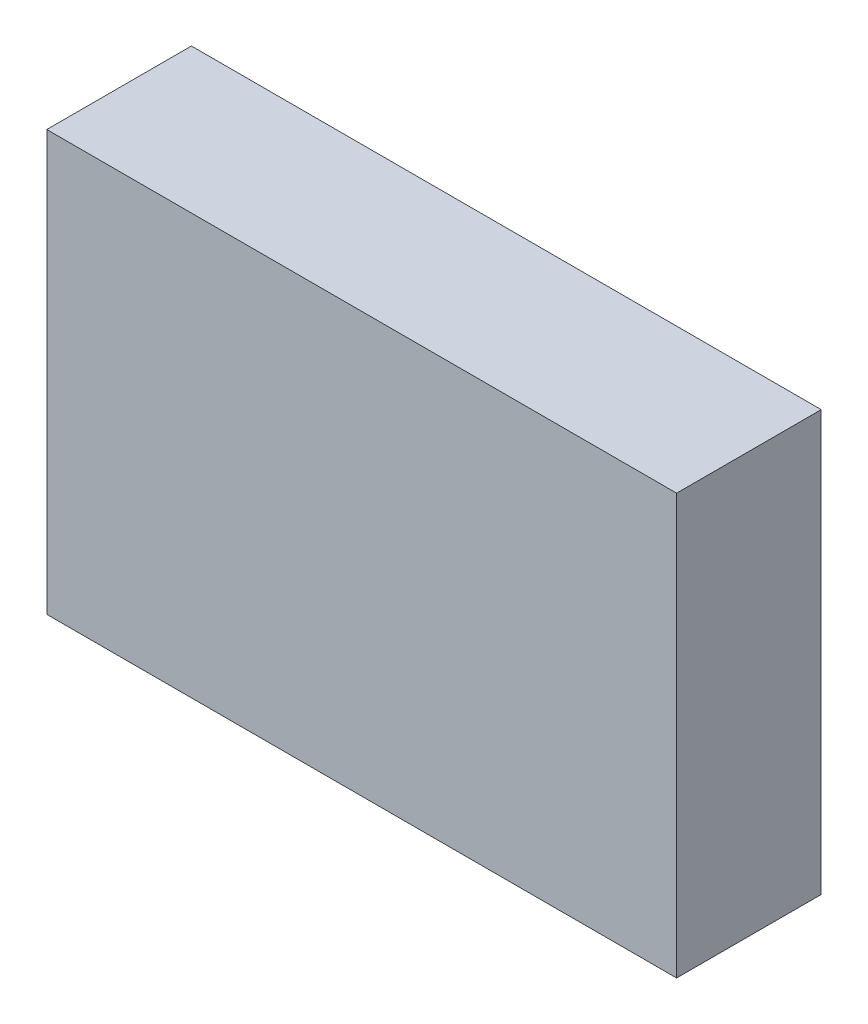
ISO-10303-21;
HEADER;
FILE_DESCRIPTION(('STEP AP214'),'2;1');
FILE_NAME('part.step','',(''),(''),'','','');
FILE_SCHEMA(('AUTOMOTIVE_DESIGN { 1 0 10303 214 1 1 1 1 }'));
ENDSEC;
DATA;
#1=APPLICATION_CONTEXT('core data for automotive mechanical design processes');
#2=APPLICATION_PROTOCOL_DEFINITION('international standard','automotive_design',2000,#1);
#3=PRODUCT_CONTEXT('',#1,'mechanical');
#4=PRODUCT('Part','Part','',(#3));
#5=PRODUCT_RELATED_PRODUCT_CATEGORY('part','',(#4));
#6=PRODUCT_DEFINITION_FORMATION('','',#4);
#7=PRODUCT_DEFINITION_CONTEXT('part definition',#1,'design');
#8=PRODUCT_DEFINITION('design','',#6,#7);
#9=PRODUCT_DEFINITION_SHAPE('','',#8);
#10=(LENGTH_UNIT() NAMED_UNIT(*) SI_UNIT(.MILLI.,.METRE.));
#11=(NAMED_UNIT(*) PLANE_ANGLE_UNIT() SI_UNIT($,.RADIAN.));
#12=(NAMED_UNIT(*) SI_UNIT($,.STERADIAN.) SOLID_ANGLE_UNIT());
#13=UNCERTAINTY_MEASURE_WITH_UNIT(LENGTH_MEASURE(1.E-05),#10,'distance_accuracy_value','');
#14=(GEOMETRIC_REPRESENTATION_CONTEXT(3) GLOBAL_UNCERTAINTY_ASSIGNED_CONTEXT((#13)) GLOBAL_UNIT_ASSIGNED_CONTEXT((#10,
#11,#12)) REPRESENTATION_CONTEXT('',''));
#15=CARTESIAN_POINT('',(0.,0.,0.));
#16=DIRECTION('',(0.,0.,1.));
#17=DIRECTION('',(1.,0.,0.));
#18=AXIS2_PLACEMENT_3D('',#15,#16,#17);
#19=CARTESIAN_POINT('',(-3.81,2.54,1.75));
#20=DIRECTION('',(1.,0.,0.));
#21=DIRECTION('',(0.,0.,-1.));
#22=AXIS2_PLACEMENT_3D('',#19,#20,#21);
#23=PLANE('',#22);
#24=DIRECTION('',(0.,-1.,0.));
#25=VECTOR('',#24,1.);
#26=CARTESIAN_POINT('',(-3.81,2.54,0.));
#27=LINE('',#26,#25);
#28=CARTESIAN_POINT('',(-3.81,2.54,0.));
#29=VERTEX_POINT('',#28);
#30=CARTESIAN_POINT('',(-3.81,-2.54,0.));
#31=VERTEX_POINT('',#30);
#32=EDGE_CURVE('E96',#29,#31,#27,.T.);
#33=ORIENTED_EDGE('',*,*,#32,.T.);
#34=DIRECTION('',(0.,0.,-1.));
#35=VECTOR('',#34,1.);
#36=CARTESIAN_POINT('',(-3.81,-2.54,1.75));
#37=LINE('',#36,#35);
#38=CARTESIAN_POINT('',(-3.81,-2.54,1.75));
#39=VERTEX_POINT('',#38);
#40=EDGE_CURVE('E11',#39,#31,#37,.T.);
#41=ORIENTED_EDGE('',*,*,#40,.F.);
#42=DIRECTION('',(0.,-1.,0.));
#43=VECTOR('',#42,1.);
#44=CARTESIAN_POINT('',(-3.81,2.54,1.75));
#45=LINE('',#44,#43);
#46=CARTESIAN_POINT('',(-3.81,2.54,1.75));
#47=VERTEX_POINT('',#46);
#48=EDGE_CURVE('E84',#47,#39,#45,.T.);
#49=ORIENTED_EDGE('',*,*,#48,.F.);
#50=DIRECTION('',(0.,0.,-1.));
#51=VECTOR('',#50,1.);
#52=CARTESIAN_POINT('',(-3.81,2.54,1.75));
#53=LINE('',#52,#51);
#54=EDGE_CURVE('E92',#47,#29,#53,.T.);
#55=ORIENTED_EDGE('',*,*,#54,.T.);
#56=EDGE_LOOP('',(#33,#41,#49,#55));
#57=FACE_BOUND('',#56,.T.);
#58=ADVANCED_FACE('F33',(#57),#23,.F.);
#59=CARTESIAN_POINT('',(-3.81,-2.54,1.75));
#60=DIRECTION('',(0.,1.,0.));
#61=DIRECTION('',(0.,0.,1.));
#62=AXIS2_PLACEMENT_3D('',#59,#60,#61);
#63=PLANE('',#62);
#64=DIRECTION('',(1.,0.,0.));
#65=VECTOR('',#64,1.);
#66=CARTESIAN_POINT('',(-3.81,-2.54,0.));
#67=LINE('',#66,#65);
#68=CARTESIAN_POINT('',(3.81,-2.54,0.));
#69=VERTEX_POINT('',#68);
#70=EDGE_CURVE('E88',#31,#69,#67,.T.);
#71=ORIENTED_EDGE('',*,*,#70,.T.);
#72=DIRECTION('',(0.,0.,-1.));
#73=VECTOR('',#72,1.);
#74=CARTESIAN_POINT('',(3.81,-2.54,1.75));
#75=LINE('',#74,#73);
#76=CARTESIAN_POINT('',(3.81,-2.54,1.75));
#77=VERTEX_POINT('',#76);
#78=EDGE_CURVE('E41',#77,#69,#75,.T.);
#79=ORIENTED_EDGE('',*,*,#78,.F.);
#80=DIRECTION('',(1.,0.,0.));
#81=VECTOR('',#80,1.);
#82=CARTESIAN_POINT('',(-3.81,-2.54,1.75));
#83=LINE('',#82,#81);
#84=EDGE_CURVE('E79',#39,#77,#83,.T.);
#85=ORIENTED_EDGE('',*,*,#84,.F.);
#86=ORIENTED_EDGE('',*,*,#40,.T.);
#87=EDGE_LOOP('',(#71,#79,#85,#86));
#88=FACE_BOUND('',#87,.T.);
#89=ADVANCED_FACE('F87',(#88),#63,.F.);
#90=CARTESIAN_POINT('',(3.81,-2.54,1.75));
#91=DIRECTION('',(-1.,0.,0.));
#92=DIRECTION('',(0.,0.,1.));
#93=AXIS2_PLACEMENT_3D('',#90,#91,#92);
#94=PLANE('',#93);
#95=DIRECTION('',(0.,1.,0.));
#96=VECTOR('',#95,1.);
#97=CARTESIAN_POINT('',(3.81,-2.54,0.));
#98=LINE('',#97,#96);
#99=CARTESIAN_POINT('',(3.81,2.54,0.));
#100=VERTEX_POINT('',#99);
#101=EDGE_CURVE('E66',#69,#100,#98,.T.);
#102=ORIENTED_EDGE('',*,*,#101,.T.);
#103=DIRECTION('',(0.,0.,-1.));
#104=VECTOR('',#103,1.);
#105=CARTESIAN_POINT('',(3.81,2.54,1.75));
#106=LINE('',#105,#104);
#107=CARTESIAN_POINT('',(3.81,2.54,1.75));
#108=VERTEX_POINT('',#107);
#109=EDGE_CURVE('E89',#108,#100,#106,.T.);
#110=ORIENTED_EDGE('',*,*,#109,.F.);
#111=DIRECTION('',(0.,1.,0.));
#112=VECTOR('',#111,1.);
#113=CARTESIAN_POINT('',(3.81,-2.54,1.75));
#114=LINE('',#113,#112);
#115=EDGE_CURVE('E82',#77,#108,#114,.T.);
#116=ORIENTED_EDGE('',*,*,#115,.F.);
#117=ORIENTED_EDGE('',*,*,#78,.T.);
#118=EDGE_LOOP('',(#102,#110,#116,#117));
#119=FACE_BOUND('',#118,.T.);
#120=ADVANCED_FACE('F90',(#119),#94,.F.);
#121=CARTESIAN_POINT('',(3.81,2.54,1.75));
#122=DIRECTION('',(0.,-1.,0.));
#123=DIRECTION('',(0.,0.,-1.));
#124=AXIS2_PLACEMENT_3D('',#121,#122,#123);
#125=PLANE('',#124);
#126=DIRECTION('',(-1.,0.,0.));
#127=VECTOR('',#126,1.);
#128=CARTESIAN_POINT('',(3.81,2.54,0.));
#129=LINE('',#128,#127);
#130=EDGE_CURVE('E72',#100,#29,#129,.T.);
#131=ORIENTED_EDGE('',*,*,#130,.T.);
#132=ORIENTED_EDGE('',*,*,#54,.F.);
#133=DIRECTION('',(-1.,0.,0.));
#134=VECTOR('',#133,1.);
#135=CARTESIAN_POINT('',(3.81,2.54,1.75));
#136=LINE('',#135,#134);
#137=EDGE_CURVE('E49',#108,#47,#136,.T.);
#138=ORIENTED_EDGE('',*,*,#137,.F.);
#139=ORIENTED_EDGE('',*,*,#109,.T.);
#140=EDGE_LOOP('',(#131,#132,#138,#139));
#141=FACE_BOUND('',#140,.T.);
#142=ADVANCED_FACE('F103',(#141),#125,.F.);
#143=CARTESIAN_POINT('',(0.,0.,1.75));
#144=DIRECTION('',(0.,0.,1.));
#145=DIRECTION('',(1.,0.,0.));
#146=AXIS2_PLACEMENT_3D('',#143,#144,#145);
#147=PLANE('',#146);
#148=ORIENTED_EDGE('',*,*,#48,.T.);
#149=ORIENTED_EDGE('',*,*,#84,.T.);
#150=ORIENTED_EDGE('',*,*,#115,.T.);
#151=ORIENTED_EDGE('',*,*,#137,.T.);
#152=EDGE_LOOP('',(#148,#149,#150,#151));
#153=FACE_BOUND('',#152,.T.);
#154=ADVANCED_FACE('F80',(#153),#147,.T.);
#155=CARTESIAN_POINT('',(0.,0.,0.));
#156=DIRECTION('',(0.,0.,1.));
#157=DIRECTION('',(1.,0.,0.));
#158=AXIS2_PLACEMENT_3D('',#155,#156,#157);
#159=PLANE('',#158);
#160=ORIENTED_EDGE('',*,*,#32,.F.);
#161=ORIENTED_EDGE('',*,*,#130,.F.);
#162=ORIENTED_EDGE('',*,*,#101,.F.);
#163=ORIENTED_EDGE('',*,*,#70,.F.);
#164=EDGE_LOOP('',(#160,#161,#162,#163));
#165=FACE_BOUND('',#164,.T.);
#166=ADVANCED_FACE('F106',(#165),#159,.F.);
#167=CLOSED_SHELL('',(#58,#89,#120,#142,#154,#166));
#168=MANIFOLD_SOLID_BREP('B2',#167);
#169=ADVANCED_BREP_SHAPE_REPRESENTATION('',(#18,#168),#14);
#170=SHAPE_DEFINITION_REPRESENTATION(#9,#169);
ENDSEC;
END-ISO-10303-21;
